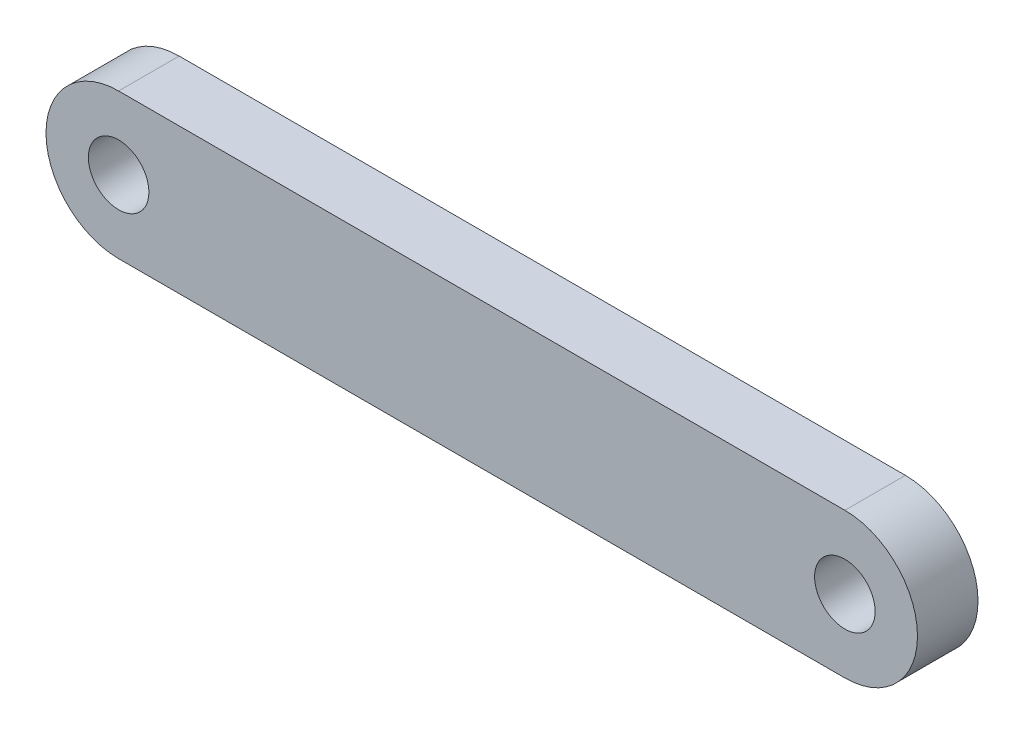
ISO-10303-21;
HEADER;
FILE_DESCRIPTION(('STEP AP214'),'2;1');
FILE_NAME('part.step','',(''),(''),'','','');
FILE_SCHEMA(('AUTOMOTIVE_DESIGN { 1 0 10303 214 1 1 1 1 }'));
ENDSEC;
DATA;
#1=APPLICATION_CONTEXT('core data for automotive mechanical design processes');
#2=APPLICATION_PROTOCOL_DEFINITION('international standard','automotive_design',2000,#1);
#3=PRODUCT_CONTEXT('',#1,'mechanical');
#4=PRODUCT('Part','Part','',(#3));
#5=PRODUCT_RELATED_PRODUCT_CATEGORY('part','',(#4));
#6=PRODUCT_DEFINITION_FORMATION('','',#4);
#7=PRODUCT_DEFINITION_CONTEXT('part definition',#1,'design');
#8=PRODUCT_DEFINITION('design','',#6,#7);
#9=PRODUCT_DEFINITION_SHAPE('','',#8);
#10=(LENGTH_UNIT() NAMED_UNIT(*) SI_UNIT(.MILLI.,.METRE.));
#11=(NAMED_UNIT(*) PLANE_ANGLE_UNIT() SI_UNIT($,.RADIAN.));
#12=(NAMED_UNIT(*) SI_UNIT($,.STERADIAN.) SOLID_ANGLE_UNIT());
#13=UNCERTAINTY_MEASURE_WITH_UNIT(LENGTH_MEASURE(1.E-05),#10,'distance_accuracy_value','');
#14=(GEOMETRIC_REPRESENTATION_CONTEXT(3) GLOBAL_UNCERTAINTY_ASSIGNED_CONTEXT((#13)) GLOBAL_UNIT_ASSIGNED_CONTEXT((#10,
#11,#12)) REPRESENTATION_CONTEXT('',''));
#15=CARTESIAN_POINT('',(0.,0.,0.));
#16=DIRECTION('',(0.,0.,1.));
#17=DIRECTION('',(1.,0.,0.));
#18=AXIS2_PLACEMENT_3D('',#15,#16,#17);
#19=CARTESIAN_POINT('',(-30.,0.,2.5));
#20=DIRECTION('',(0.,0.,1.));
#21=DIRECTION('',(1.,0.,0.));
#22=AXIS2_PLACEMENT_3D('',#19,#20,#21);
#23=PLANE('',#22);
#24=CARTESIAN_POINT('',(30.,0.,2.5));
#25=DIRECTION('',(0.,0.,1.));
#26=DIRECTION('',(1.,0.,0.));
#27=AXIS2_PLACEMENT_3D('',#24,#25,#26);
#28=CIRCLE('',#27,2.49999999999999);
#29=CARTESIAN_POINT('',(32.5,0.,2.5));
#30=VERTEX_POINT('',#29);
#31=EDGE_CURVE('E108',#30,#30,#28,.T.);
#32=ORIENTED_EDGE('',*,*,#31,.F.);
#33=EDGE_LOOP('',(#32));
#34=FACE_BOUND('',#33,.T.);
#35=CARTESIAN_POINT('',(-30.,0.,2.5));
#36=DIRECTION('',(0.,0.,1.));
#37=DIRECTION('',(1.,0.,0.));
#38=AXIS2_PLACEMENT_3D('',#35,#36,#37);
#39=CIRCLE('',#38,6.00000000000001);
#40=CARTESIAN_POINT('',(-30.,6.00000000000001,2.5));
#41=VERTEX_POINT('',#40);
#42=CARTESIAN_POINT('',(-30.,-6.00000000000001,2.5));
#43=VERTEX_POINT('',#42);
#44=EDGE_CURVE('E93',#41,#43,#39,.T.);
#45=ORIENTED_EDGE('',*,*,#44,.T.);
#46=DIRECTION('',(1.,0.,0.));
#47=VECTOR('',#46,1.);
#48=CARTESIAN_POINT('',(-30.,-6.00000000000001,2.5));
#49=LINE('',#48,#47);
#50=CARTESIAN_POINT('',(30.,-6.,2.5));
#51=VERTEX_POINT('',#50);
#52=EDGE_CURVE('E88',#43,#51,#49,.T.);
#53=ORIENTED_EDGE('',*,*,#52,.T.);
#54=CARTESIAN_POINT('',(30.,0.,2.5));
#55=DIRECTION('',(0.,0.,1.));
#56=DIRECTION('',(1.,0.,0.));
#57=AXIS2_PLACEMENT_3D('',#54,#55,#56);
#58=CIRCLE('',#57,6.00000000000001);
#59=CARTESIAN_POINT('',(30.,6.00000000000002,2.5));
#60=VERTEX_POINT('',#59);
#61=EDGE_CURVE('E91',#51,#60,#58,.T.);
#62=ORIENTED_EDGE('',*,*,#61,.T.);
#63=DIRECTION('',(-1.,0.,0.));
#64=VECTOR('',#63,1.);
#65=CARTESIAN_POINT('',(-30.,6.00000000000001,2.5));
#66=LINE('',#65,#64);
#67=EDGE_CURVE('E58',#60,#41,#66,.T.);
#68=ORIENTED_EDGE('',*,*,#67,.T.);
#69=EDGE_LOOP('',(#45,#53,#62,#68));
#70=FACE_BOUND('',#69,.T.);
#71=CARTESIAN_POINT('',(-30.,0.,2.5));
#72=DIRECTION('',(0.,0.,1.));
#73=DIRECTION('',(1.,0.,0.));
#74=AXIS2_PLACEMENT_3D('',#71,#72,#73);
#75=CIRCLE('',#74,2.50000000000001);
#76=CARTESIAN_POINT('',(-27.5,0.,2.5));
#77=VERTEX_POINT('',#76);
#78=EDGE_CURVE('E123',#77,#77,#75,.T.);
#79=ORIENTED_EDGE('',*,*,#78,.F.);
#80=EDGE_LOOP('',(#79));
#81=FACE_BOUND('',#80,.T.);
#82=ADVANCED_FACE('F41',(#34,#70,#81),#23,.T.);
#83=CARTESIAN_POINT('',(-30.,0.,-2.5));
#84=DIRECTION('',(0.,0.,1.));
#85=DIRECTION('',(1.,0.,0.));
#86=AXIS2_PLACEMENT_3D('',#83,#84,#85);
#87=PLANE('',#86);
#88=CARTESIAN_POINT('',(-30.,0.,-2.5));
#89=DIRECTION('',(0.,0.,1.));
#90=DIRECTION('',(1.,0.,0.));
#91=AXIS2_PLACEMENT_3D('',#88,#89,#90);
#92=CIRCLE('',#91,6.00000000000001);
#93=CARTESIAN_POINT('',(-30.,6.00000000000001,-2.5));
#94=VERTEX_POINT('',#93);
#95=CARTESIAN_POINT('',(-30.,-6.00000000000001,-2.5));
#96=VERTEX_POINT('',#95);
#97=EDGE_CURVE('E105',#94,#96,#92,.T.);
#98=ORIENTED_EDGE('',*,*,#97,.F.);
#99=DIRECTION('',(-1.,0.,0.));
#100=VECTOR('',#99,1.);
#101=CARTESIAN_POINT('',(-30.,6.00000000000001,-2.5));
#102=LINE('',#101,#100);
#103=CARTESIAN_POINT('',(30.,6.00000000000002,-2.5));
#104=VERTEX_POINT('',#103);
#105=EDGE_CURVE('E81',#104,#94,#102,.T.);
#106=ORIENTED_EDGE('',*,*,#105,.F.);
#107=CARTESIAN_POINT('',(30.,0.,-2.5));
#108=DIRECTION('',(0.,0.,1.));
#109=DIRECTION('',(1.,0.,0.));
#110=AXIS2_PLACEMENT_3D('',#107,#108,#109);
#111=CIRCLE('',#110,6.00000000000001);
#112=CARTESIAN_POINT('',(30.,-6.,-2.5));
#113=VERTEX_POINT('',#112);
#114=EDGE_CURVE('E75',#113,#104,#111,.T.);
#115=ORIENTED_EDGE('',*,*,#114,.F.);
#116=DIRECTION('',(1.,0.,0.));
#117=VECTOR('',#116,1.);
#118=CARTESIAN_POINT('',(-30.,-6.00000000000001,-2.5));
#119=LINE('',#118,#117);
#120=EDGE_CURVE('E97',#96,#113,#119,.T.);
#121=ORIENTED_EDGE('',*,*,#120,.F.);
#122=EDGE_LOOP('',(#98,#106,#115,#121));
#123=FACE_BOUND('',#122,.T.);
#124=CARTESIAN_POINT('',(30.,0.,-2.5));
#125=DIRECTION('',(0.,0.,1.));
#126=DIRECTION('',(1.,0.,0.));
#127=AXIS2_PLACEMENT_3D('',#124,#125,#126);
#128=CIRCLE('',#127,2.49999999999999);
#129=CARTESIAN_POINT('',(32.5,0.,-2.5));
#130=VERTEX_POINT('',#129);
#131=EDGE_CURVE('E120',#130,#130,#128,.T.);
#132=ORIENTED_EDGE('',*,*,#131,.T.);
#133=EDGE_LOOP('',(#132));
#134=FACE_BOUND('',#133,.T.);
#135=CARTESIAN_POINT('',(-30.,0.,-2.5));
#136=DIRECTION('',(0.,0.,1.));
#137=DIRECTION('',(1.,0.,0.));
#138=AXIS2_PLACEMENT_3D('',#135,#136,#137);
#139=CIRCLE('',#138,2.50000000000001);
#140=CARTESIAN_POINT('',(-27.5,0.,-2.5));
#141=VERTEX_POINT('',#140);
#142=EDGE_CURVE('E126',#141,#141,#139,.T.);
#143=ORIENTED_EDGE('',*,*,#142,.T.);
#144=EDGE_LOOP('',(#143));
#145=FACE_BOUND('',#144,.T.);
#146=ADVANCED_FACE('F116',(#123,#134,#145),#87,.F.);
#147=CARTESIAN_POINT('',(-30.,0.,2.5));
#148=DIRECTION('',(0.,0.,-1.));
#149=DIRECTION('',(-1.,0.,0.));
#150=AXIS2_PLACEMENT_3D('',#147,#148,#149);
#151=CYLINDRICAL_SURFACE('',#150,6.00000000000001);
#152=ORIENTED_EDGE('',*,*,#97,.T.);
#153=DIRECTION('',(0.,0.,-1.));
#154=VECTOR('',#153,1.);
#155=CARTESIAN_POINT('',(-30.,-6.00000000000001,2.5));
#156=LINE('',#155,#154);
#157=EDGE_CURVE('E11',#43,#96,#156,.T.);
#158=ORIENTED_EDGE('',*,*,#157,.F.);
#159=ORIENTED_EDGE('',*,*,#44,.F.);
#160=DIRECTION('',(0.,0.,-1.));
#161=VECTOR('',#160,1.);
#162=CARTESIAN_POINT('',(-30.,6.00000000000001,2.5));
#163=LINE('',#162,#161);
#164=EDGE_CURVE('E101',#41,#94,#163,.T.);
#165=ORIENTED_EDGE('',*,*,#164,.T.);
#166=EDGE_LOOP('',(#152,#158,#159,#165));
#167=FACE_BOUND('',#166,.T.);
#168=ADVANCED_FACE('F43',(#167),#151,.T.);
#169=CARTESIAN_POINT('',(-30.,-6.00000000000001,2.5));
#170=DIRECTION('',(0.,1.,0.));
#171=DIRECTION('',(-1.,0.,0.));
#172=AXIS2_PLACEMENT_3D('',#169,#170,#171);
#173=PLANE('',#172);
#174=ORIENTED_EDGE('',*,*,#120,.T.);
#175=DIRECTION('',(0.,0.,-1.));
#176=VECTOR('',#175,1.);
#177=CARTESIAN_POINT('',(30.,-6.,2.5));
#178=LINE('',#177,#176);
#179=EDGE_CURVE('E50',#51,#113,#178,.T.);
#180=ORIENTED_EDGE('',*,*,#179,.F.);
#181=ORIENTED_EDGE('',*,*,#52,.F.);
#182=ORIENTED_EDGE('',*,*,#157,.T.);
#183=EDGE_LOOP('',(#174,#180,#181,#182));
#184=FACE_BOUND('',#183,.T.);
#185=ADVANCED_FACE('F96',(#184),#173,.F.);
#186=CARTESIAN_POINT('',(30.,0.,2.5));
#187=DIRECTION('',(0.,0.,-1.));
#188=DIRECTION('',(-1.,0.,0.));
#189=AXIS2_PLACEMENT_3D('',#186,#187,#188);
#190=CYLINDRICAL_SURFACE('',#189,6.00000000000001);
#191=ORIENTED_EDGE('',*,*,#114,.T.);
#192=DIRECTION('',(0.,0.,-1.));
#193=VECTOR('',#192,1.);
#194=CARTESIAN_POINT('',(30.,6.00000000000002,2.5));
#195=LINE('',#194,#193);
#196=EDGE_CURVE('E98',#60,#104,#195,.T.);
#197=ORIENTED_EDGE('',*,*,#196,.F.);
#198=ORIENTED_EDGE('',*,*,#61,.F.);
#199=ORIENTED_EDGE('',*,*,#179,.T.);
#200=EDGE_LOOP('',(#191,#197,#198,#199));
#201=FACE_BOUND('',#200,.T.);
#202=ADVANCED_FACE('F99',(#201),#190,.T.);
#203=CARTESIAN_POINT('',(-30.,6.00000000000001,2.5));
#204=DIRECTION('',(0.,-1.,0.));
#205=DIRECTION('',(1.,0.,0.));
#206=AXIS2_PLACEMENT_3D('',#203,#204,#205);
#207=PLANE('',#206);
#208=ORIENTED_EDGE('',*,*,#105,.T.);
#209=ORIENTED_EDGE('',*,*,#164,.F.);
#210=ORIENTED_EDGE('',*,*,#67,.F.);
#211=ORIENTED_EDGE('',*,*,#196,.T.);
#212=EDGE_LOOP('',(#208,#209,#210,#211));
#213=FACE_BOUND('',#212,.T.);
#214=ADVANCED_FACE('F113',(#213),#207,.F.);
#215=CARTESIAN_POINT('',(30.,0.,2.5));
#216=DIRECTION('',(0.,0.,-1.));
#217=DIRECTION('',(-1.,0.,0.));
#218=AXIS2_PLACEMENT_3D('',#215,#216,#217);
#219=CYLINDRICAL_SURFACE('',#218,2.49999999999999);
#220=ORIENTED_EDGE('',*,*,#31,.T.);
#221=EDGE_LOOP('',(#220));
#222=FACE_BOUND('',#221,.T.);
#223=ORIENTED_EDGE('',*,*,#131,.F.);
#224=EDGE_LOOP('',(#223));
#225=FACE_BOUND('',#224,.T.);
#226=ADVANCED_FACE('F143',(#222,#225),#219,.F.);
#227=CARTESIAN_POINT('',(-30.,0.,2.5));
#228=DIRECTION('',(0.,0.,-1.));
#229=DIRECTION('',(-1.,0.,0.));
#230=AXIS2_PLACEMENT_3D('',#227,#228,#229);
#231=CYLINDRICAL_SURFACE('',#230,2.50000000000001);
#232=ORIENTED_EDGE('',*,*,#78,.T.);
#233=EDGE_LOOP('',(#232));
#234=FACE_BOUND('',#233,.T.);
#235=ORIENTED_EDGE('',*,*,#142,.F.);
#236=EDGE_LOOP('',(#235));
#237=FACE_BOUND('',#236,.T.);
#238=ADVANCED_FACE('F132',(#234,#237),#231,.F.);
#239=CLOSED_SHELL('',(#82,#146,#168,#185,#202,#214,#226,#238));
#240=MANIFOLD_SOLID_BREP('B2',#239);
#241=ADVANCED_BREP_SHAPE_REPRESENTATION('',(#18,#240),#14);
#242=SHAPE_DEFINITION_REPRESENTATION(#9,#241);
ENDSEC;
END-ISO-10303-21;
